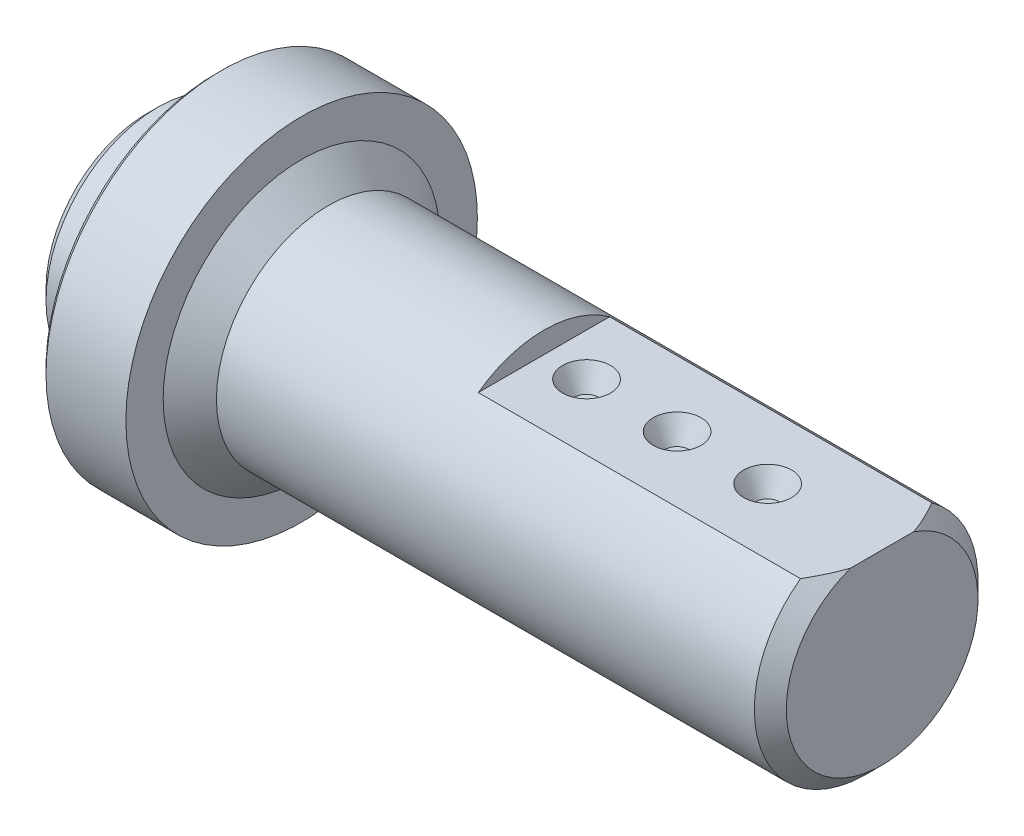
from build123d import *

# Parameters (mm, degrees)
CHANFREIN_2_45_SIZE                  = 2
CHANFREIN_1_45_SIZE                  = 1
CHANFREIN_3_45_SIZE                  = 3
ESQUISSE3_R                          = 8.5
AL_SAGE_CAPTEUR_DEPTH                = 16
ESQUISSE4_W                          = 1.1
ESQUISSE4_H                          = 8.9
CHANFREIN_1_5_45_SIZE                = 1.5
TARAUDAGE_R_EL_COUNT                 = 23
TARAUDAGE_R_EL_PITCH                 = 0.58
R_P_TITION_TROU_TARAUD_M6_COUNT      = 3
ESQUISSE7_R                          = 12
AL_SAGE_FOURCHETTE_DEPTH             = 30
M_PLAT_DEPTH                         = 146.677726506
M_PLAT_DEPTH_BACK                    = 146.677726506
ESQUISSE2_W                          = 89.086352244
ESQUISSE2_H                          = 23.534290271
ESQUISSE9_R                          = 4.5
TROU_D_INDEXAGE_DEPTH                = 4
TROU_D_INDEXAGE_DRAFT                = -30
R_P_TITION_LIN_AIRE1_COPY_1_SKETCH_R = 4.5
R_P_TITION_LIN_AIRE1_COPY_1_DEPTH    = 4
R_P_TITION_LIN_AIRE1_COPY_1_DRAFT    = -30
R_P_TITION_LIN_AIRE1_COPY_2_SKETCH_R = 4.5
R_P_TITION_LIN_AIRE1_COPY_2_DEPTH    = 4
R_P_TITION_LIN_AIRE1_COPY_2_DRAFT    = -30


with BuildPart() as part:
    # Esquisse1 → Arbre (revolve)
    with BuildSketch(Plane.XY, mode=Mode.PRIVATE) as arbre_sk:
        Polygon((0, 0), (0, 21), (13, 21), (13, 33), (29, 33), (29, 26), (34, 21), (138, 21), (138, 0), align=None)
    revolve(arbre_sk.sketch.rotate(Axis((0, 0, 0), (1, 0, 0)), 90), axis=Axis((0, 0, 0), (1, 0, 0)))

    # Chanfrein 2 _ 45
    chanfrein_2_45_edges = [part.edges().sort_by_distance(p)[0] for p in [
        (0, 0, -21),
    ]]
    chamfer(chanfrein_2_45_edges, length=CHANFREIN_2_45_SIZE)

    # Chanfrein 1 _ 45
    chanfrein_1_45_edges = [part.edges().sort_by_distance(p)[0] for p in [
        (13, 0, -33),
    ]]
    chamfer(chanfrein_1_45_edges, length=CHANFREIN_1_45_SIZE)

    # Chanfrein 3 _ 45
    chanfrein_3_45_edges = [part.edges().sort_by_distance(p)[0] for p in [
        (138, 0, -21),
    ]]
    chamfer(chanfrein_3_45_edges, length=CHANFREIN_3_45_SIZE)

    # Esquisse3 → Al_sage capteur (cut)
    with BuildSketch(Plane.ZY):
        Circle(ESQUISSE3_R)
    extrude(amount=-AL_SAGE_CAPTEUR_DEPTH, mode=Mode.SUBTRACT)

    # Esquisse4 → Gorge (revolve, cut)
    with BuildSketch(Plane.XY, mode=Mode.PRIVATE) as gorge_sk:
        with Locations((9.45, 4.45)):
            Rectangle(ESQUISSE4_W, ESQUISSE4_H)
    revolve(gorge_sk.sketch.rotate(Axis((0, 0, 0), (1, 0, 0)), 90), axis=Axis((0, 0, 0), (1, 0, 0)), mode=Mode.SUBTRACT)

    # Chanfrein 1_5 _ 45
    chanfrein_1_5_45_edges = [part.edges().sort_by_distance(p)[0] for p in [
        (0, 0, -8.5),
    ]]
    chamfer(chanfrein_1_5_45_edges, length=CHANFREIN_1_5_45_SIZE)

    # Esquisse5 → Trou taraud_ M6x1.01 (revolve, cut)
    with BuildSketch(Plane(origin=(13, 0, 27), x_dir=(0, 0, 1), z_dir=(0, 1, 0))):
        Polygon((0, 0), (0, 14.443375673), (2.5, 13), (2.5, 0), align=None)
    trou_taraud_m6x1_01 = revolve(axis=Axis((6.65, 0, 27), (1, 0, 0)), mode=Mode.SUBTRACT)

    # Esquisse10 → Repr_sentation taraudage (revolve, cut)
    with BuildSketch(Plane(origin=(0, 0, 0), x_dir=(1, 0, 0), z_dir=(0, 1, 0))):
        Polygon((13, -24), (12.711324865, -24.5), (13.288675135, -24.5), align=None)
    repr_sentation_taraudage = revolve(axis=Axis((13, 0, 27), (-1, 0, 0)), mode=Mode.SUBTRACT)

    # Taraudage r_el: Repr_sentation taraudage ×23
    with Locations(*[(i * TARAUDAGE_R_EL_PITCH, 0, 0) for i in range(1, TARAUDAGE_R_EL_COUNT)]):
        add(repr_sentation_taraudage, mode=Mode.SUBTRACT)

    # R_p_tition trou taraud_ M6: Trou taraud_ M6x1.01, Repr_sentation taraudage ×3 about axis
    r_p_tition_trou_taraud_m6_axis = Axis((0, 0, 0), (1, 0, 0))
    add([trou_taraud_m6x1_01.rotate(r_p_tition_trou_taraud_m6_axis, i * 360 / R_P_TITION_TROU_TARAUD_M6_COUNT) for i in range(1, R_P_TITION_TROU_TARAUD_M6_COUNT)], mode=Mode.SUBTRACT)
    add([repr_sentation_taraudage.rotate(r_p_tition_trou_taraud_m6_axis, i * 360 / R_P_TITION_TROU_TARAUD_M6_COUNT) for i in range(1, R_P_TITION_TROU_TARAUD_M6_COUNT)], mode=Mode.SUBTRACT)

    # R_p_tition trou taraud_ M6 copy 1 sketch → R_p_tition trou taraud_ M6 copy 1 (revolve, cut)
    with BuildSketch(Plane(origin=(0.58, 0, 0), x_dir=(1, 0, 0), z_dir=(0, -0.4999999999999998, 0.8660254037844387))):
        Polygon((13, -24), (12.711324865, -24.5), (13.288675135, -24.5), align=None)
    revolve(axis=Axis((13.58, -23.382685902, -13.5), (-1, 0, 0)), mode=Mode.SUBTRACT)

    # R_p_tition trou taraud_ M6 copy 2 sketch → R_p_tition trou taraud_ M6 copy 2 (revolve, cut)
    with BuildSketch(Plane(origin=(0.58, 0, 0), x_dir=(1, 0, 0), z_dir=(0, -0.5000000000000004, -0.8660254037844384))):
        Polygon((13, -24), (12.711324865, -24.5), (13.288675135, -24.5), align=None)
    revolve(axis=Axis((13.58, 23.382685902, -13.5), (-1, 0, 0)), mode=Mode.SUBTRACT)

    # R_p_tition trou taraud_ M6 copy 3 sketch → R_p_tition trou taraud_ M6 copy 3 (revolve, cut)
    with BuildSketch(Plane(origin=(1.16, 0, 0), x_dir=(1, 0, 0), z_dir=(0, -0.4999999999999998, 0.8660254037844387))):
        Polygon((13, -24), (12.711324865, -24.5), (13.288675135, -24.5), align=None)
    revolve(axis=Axis((14.16, -23.382685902, -13.5), (-1, 0, 0)), mode=Mode.SUBTRACT)

    # R_p_tition trou taraud_ M6 copy 4 sketch → R_p_tition trou taraud_ M6 copy 4 (revolve, cut)
    with BuildSketch(Plane(origin=(1.16, 0, 0), x_dir=(1, 0, 0), z_dir=(0, -0.5000000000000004, -0.8660254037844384))):
        Polygon((13, -24), (12.711324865, -24.5), (13.288675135, -24.5), align=None)
    revolve(axis=Axis((14.16, 23.382685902, -13.5), (-1, 0, 0)), mode=Mode.SUBTRACT)

    # R_p_tition trou taraud_ M6 copy 5 sketch → R_p_tition trou taraud_ M6 copy 5 (revolve, cut)
    with BuildSketch(Plane(origin=(1.74, 0, 0), x_dir=(1, 0, 0), z_dir=(0, -0.4999999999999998, 0.8660254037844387))):
        Polygon((13, -24), (12.711324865, -24.5), (13.288675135, -24.5), align=None)
    revolve(axis=Axis((14.74, -23.382685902, -13.5), (-1, 0, 0)), mode=Mode.SUBTRACT)

    # R_p_tition trou taraud_ M6 copy 6 sketch → R_p_tition trou taraud_ M6 copy 6 (revolve, cut)
    with BuildSketch(Plane(origin=(1.74, 0, 0), x_dir=(1, 0, 0), z_dir=(0, -0.5000000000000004, -0.8660254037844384))):
        Polygon((13, -24), (12.711324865, -24.5), (13.288675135, -24.5), align=None)
    revolve(axis=Axis((14.74, 23.382685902, -13.5), (-1, 0, 0)), mode=Mode.SUBTRACT)

    # R_p_tition trou taraud_ M6 copy 7 sketch → R_p_tition trou taraud_ M6 copy 7 (revolve, cut)
    with BuildSketch(Plane(origin=(2.32, 0, 0), x_dir=(1, 0, 0), z_dir=(0, -0.4999999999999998, 0.8660254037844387))):
        Polygon((13, -24), (12.711324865, -24.5), (13.288675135, -24.5), align=None)
    revolve(axis=Axis((15.32, -23.382685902, -13.5), (-1, 0, 0)), mode=Mode.SUBTRACT)

    # R_p_tition trou taraud_ M6 copy 8 sketch → R_p_tition trou taraud_ M6 copy 8 (revolve, cut)
    with BuildSketch(Plane(origin=(2.32, 0, 0), x_dir=(1, 0, 0), z_dir=(0, -0.5000000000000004, -0.8660254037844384))):
        Polygon((13, -24), (12.711324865, -24.5), (13.288675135, -24.5), align=None)
    revolve(axis=Axis((15.32, 23.382685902, -13.5), (-1, 0, 0)), mode=Mode.SUBTRACT)

    # R_p_tition trou taraud_ M6 copy 9 sketch → R_p_tition trou taraud_ M6 copy 9 (revolve, cut)
    with BuildSketch(Plane(origin=(2.9, 0, 0), x_dir=(1, 0, 0), z_dir=(0, -0.4999999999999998, 0.8660254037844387))):
        Polygon((13, -24), (12.711324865, -24.5), (13.288675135, -24.5), align=None)
    revolve(axis=Axis((15.9, -23.382685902, -13.5), (-1, 0, 0)), mode=Mode.SUBTRACT)

    # R_p_tition trou taraud_ M6 copy 10 sketc → R_p_tition trou taraud_ M6 copy 10 (revolve, cut)
    with BuildSketch(Plane(origin=(2.9, 0, 0), x_dir=(1, 0, 0), z_dir=(0, -0.5000000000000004, -0.8660254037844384))):
        Polygon((13, -24), (12.711324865, -24.5), (13.288675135, -24.5), align=None)
    revolve(axis=Axis((15.9, 23.382685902, -13.5), (-1, 0, 0)), mode=Mode.SUBTRACT)

    # R_p_tition trou taraud_ M6 copy 11 sketc → R_p_tition trou taraud_ M6 copy 11 (revolve, cut)
    with BuildSketch(Plane(origin=(3.48, 0, 0), x_dir=(1, 0, 0), z_dir=(0, -0.4999999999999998, 0.8660254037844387))):
        Polygon((13, -24), (12.711324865, -24.5), (13.288675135, -24.5), align=None)
    revolve(axis=Axis((16.48, -23.382685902, -13.5), (-1, 0, 0)), mode=Mode.SUBTRACT)

    # R_p_tition trou taraud_ M6 copy 12 sketc → R_p_tition trou taraud_ M6 copy 12 (revolve, cut)
    with BuildSketch(Plane(origin=(3.48, 0, 0), x_dir=(1, 0, 0), z_dir=(0, -0.5000000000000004, -0.8660254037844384))):
        Polygon((13, -24), (12.711324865, -24.5), (13.288675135, -24.5), align=None)
    revolve(axis=Axis((16.48, 23.382685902, -13.5), (-1, 0, 0)), mode=Mode.SUBTRACT)

    # R_p_tition trou taraud_ M6 copy 13 sketc → R_p_tition trou taraud_ M6 copy 13 (revolve, cut)
    with BuildSketch(Plane(origin=(4.06, 0, 0), x_dir=(1, 0, 0), z_dir=(0, -0.4999999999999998, 0.8660254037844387))):
        Polygon((13, -24), (12.711324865, -24.5), (13.288675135, -24.5), align=None)
    revolve(axis=Axis((17.06, -23.382685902, -13.5), (-1, 0, 0)), mode=Mode.SUBTRACT)

    # R_p_tition trou taraud_ M6 copy 14 sketc → R_p_tition trou taraud_ M6 copy 14 (revolve, cut)
    with BuildSketch(Plane(origin=(4.06, 0, 0), x_dir=(1, 0, 0), z_dir=(0, -0.5000000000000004, -0.8660254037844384))):
        Polygon((13, -24), (12.711324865, -24.5), (13.288675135, -24.5), align=None)
    revolve(axis=Axis((17.06, 23.382685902, -13.5), (-1, 0, 0)), mode=Mode.SUBTRACT)

    # R_p_tition trou taraud_ M6 copy 15 sketc → R_p_tition trou taraud_ M6 copy 15 (revolve, cut)
    with BuildSketch(Plane(origin=(4.64, 0, 0), x_dir=(1, 0, 0), z_dir=(0, -0.4999999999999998, 0.8660254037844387))):
        Polygon((13, -24), (12.711324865, -24.5), (13.288675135, -24.5), align=None)
    revolve(axis=Axis((17.64, -23.382685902, -13.5), (-1, 0, 0)), mode=Mode.SUBTRACT)

    # R_p_tition trou taraud_ M6 copy 16 sketc → R_p_tition trou taraud_ M6 copy 16 (revolve, cut)
    with BuildSketch(Plane(origin=(4.64, 0, 0), x_dir=(1, 0, 0), z_dir=(0, -0.5000000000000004, -0.8660254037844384))):
        Polygon((13, -24), (12.711324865, -24.5), (13.288675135, -24.5), align=None)
    revolve(axis=Axis((17.64, 23.382685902, -13.5), (-1, 0, 0)), mode=Mode.SUBTRACT)

    # R_p_tition trou taraud_ M6 copy 17 sketc → R_p_tition trou taraud_ M6 copy 17 (revolve, cut)
    with BuildSketch(Plane(origin=(5.22, 0, 0), x_dir=(1, 0, 0), z_dir=(0, -0.4999999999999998, 0.8660254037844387))):
        Polygon((13, -24), (12.711324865, -24.5), (13.288675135, -24.5), align=None)
    revolve(axis=Axis((18.22, -23.382685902, -13.5), (-1, 0, 0)), mode=Mode.SUBTRACT)

    # R_p_tition trou taraud_ M6 copy 18 sketc → R_p_tition trou taraud_ M6 copy 18 (revolve, cut)
    with BuildSketch(Plane(origin=(5.22, 0, 0), x_dir=(1, 0, 0), z_dir=(0, -0.5000000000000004, -0.8660254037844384))):
        Polygon((13, -24), (12.711324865, -24.5), (13.288675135, -24.5), align=None)
    revolve(axis=Axis((18.22, 23.382685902, -13.5), (-1, 0, 0)), mode=Mode.SUBTRACT)

    # R_p_tition trou taraud_ M6 copy 19 sketc → R_p_tition trou taraud_ M6 copy 19 (revolve, cut)
    with BuildSketch(Plane(origin=(5.8, 0, 0), x_dir=(1, 0, 0), z_dir=(0, -0.4999999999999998, 0.8660254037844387))):
        Polygon((13, -24), (12.711324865, -24.5), (13.288675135, -24.5), align=None)
    revolve(axis=Axis((18.8, -23.382685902, -13.5), (-1, 0, 0)), mode=Mode.SUBTRACT)

    # R_p_tition trou taraud_ M6 copy 20 sketc → R_p_tition trou taraud_ M6 copy 20 (revolve, cut)
    with BuildSketch(Plane(origin=(5.8, 0, 0), x_dir=(1, 0, 0), z_dir=(0, -0.5000000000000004, -0.8660254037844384))):
        Polygon((13, -24), (12.711324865, -24.5), (13.288675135, -24.5), align=None)
    revolve(axis=Axis((18.8, 23.382685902, -13.5), (-1, 0, 0)), mode=Mode.SUBTRACT)

    # R_p_tition trou taraud_ M6 copy 21 sketc → R_p_tition trou taraud_ M6 copy 21 (revolve, cut)
    with BuildSketch(Plane(origin=(6.38, 0, 0), x_dir=(1, 0, 0), z_dir=(0, -0.4999999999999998, 0.8660254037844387))):
        Polygon((13, -24), (12.711324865, -24.5), (13.288675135, -24.5), align=None)
    revolve(axis=Axis((19.38, -23.382685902, -13.5), (-1, 0, 0)), mode=Mode.SUBTRACT)

    # R_p_tition trou taraud_ M6 copy 22 sketc → R_p_tition trou taraud_ M6 copy 22 (revolve, cut)
    with BuildSketch(Plane(origin=(6.38, 0, 0), x_dir=(1, 0, 0), z_dir=(0, -0.5000000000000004, -0.8660254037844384))):
        Polygon((13, -24), (12.711324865, -24.5), (13.288675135, -24.5), align=None)
    revolve(axis=Axis((19.38, 23.382685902, -13.5), (-1, 0, 0)), mode=Mode.SUBTRACT)

    # R_p_tition trou taraud_ M6 copy 23 sketc → R_p_tition trou taraud_ M6 copy 23 (revolve, cut)
    with BuildSketch(Plane(origin=(6.96, 0, 0), x_dir=(1, 0, 0), z_dir=(0, -0.4999999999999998, 0.8660254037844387))):
        Polygon((13, -24), (12.711324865, -24.5), (13.288675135, -24.5), align=None)
    revolve(axis=Axis((19.96, -23.382685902, -13.5), (-1, 0, 0)), mode=Mode.SUBTRACT)

    # R_p_tition trou taraud_ M6 copy 24 sketc → R_p_tition trou taraud_ M6 copy 24 (revolve, cut)
    with BuildSketch(Plane(origin=(6.96, 0, 0), x_dir=(1, 0, 0), z_dir=(0, -0.5000000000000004, -0.8660254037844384))):
        Polygon((13, -24), (12.711324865, -24.5), (13.288675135, -24.5), align=None)
    revolve(axis=Axis((19.96, 23.382685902, -13.5), (-1, 0, 0)), mode=Mode.SUBTRACT)

    # R_p_tition trou taraud_ M6 copy 25 sketc → R_p_tition trou taraud_ M6 copy 25 (revolve, cut)
    with BuildSketch(Plane(origin=(7.54, 0, 0), x_dir=(1, 0, 0), z_dir=(0, -0.4999999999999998, 0.8660254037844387))):
        Polygon((13, -24), (12.711324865, -24.5), (13.288675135, -24.5), align=None)
    revolve(axis=Axis((20.54, -23.382685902, -13.5), (-1, 0, 0)), mode=Mode.SUBTRACT)

    # R_p_tition trou taraud_ M6 copy 26 sketc → R_p_tition trou taraud_ M6 copy 26 (revolve, cut)
    with BuildSketch(Plane(origin=(7.54, 0, 0), x_dir=(1, 0, 0), z_dir=(0, -0.5000000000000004, -0.8660254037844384))):
        Polygon((13, -24), (12.711324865, -24.5), (13.288675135, -24.5), align=None)
    revolve(axis=Axis((20.54, 23.382685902, -13.5), (-1, 0, 0)), mode=Mode.SUBTRACT)

    # R_p_tition trou taraud_ M6 copy 27 sketc → R_p_tition trou taraud_ M6 copy 27 (revolve, cut)
    with BuildSketch(Plane(origin=(8.12, 0, 0), x_dir=(1, 0, 0), z_dir=(0, -0.4999999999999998, 0.8660254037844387))):
        Polygon((13, -24), (12.711324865, -24.5), (13.288675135, -24.5), align=None)
    revolve(axis=Axis((21.12, -23.382685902, -13.5), (-1, 0, 0)), mode=Mode.SUBTRACT)

    # R_p_tition trou taraud_ M6 copy 28 sketc → R_p_tition trou taraud_ M6 copy 28 (revolve, cut)
    with BuildSketch(Plane(origin=(8.12, 0, 0), x_dir=(1, 0, 0), z_dir=(0, -0.5000000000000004, -0.8660254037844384))):
        Polygon((13, -24), (12.711324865, -24.5), (13.288675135, -24.5), align=None)
    revolve(axis=Axis((21.12, 23.382685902, -13.5), (-1, 0, 0)), mode=Mode.SUBTRACT)

    # R_p_tition trou taraud_ M6 copy 29 sketc → R_p_tition trou taraud_ M6 copy 29 (revolve, cut)
    with BuildSketch(Plane(origin=(8.7, 0, 0), x_dir=(1, 0, 0), z_dir=(0, -0.4999999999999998, 0.8660254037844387))):
        Polygon((13, -24), (12.711324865, -24.5), (13.288675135, -24.5), align=None)
    revolve(axis=Axis((21.7, -23.382685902, -13.5), (-1, 0, 0)), mode=Mode.SUBTRACT)

    # R_p_tition trou taraud_ M6 copy 30 sketc → R_p_tition trou taraud_ M6 copy 30 (revolve, cut)
    with BuildSketch(Plane(origin=(8.7, 0, 0), x_dir=(1, 0, 0), z_dir=(0, -0.5000000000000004, -0.8660254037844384))):
        Polygon((13, -24), (12.711324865, -24.5), (13.288675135, -24.5), align=None)
    revolve(axis=Axis((21.7, 23.382685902, -13.5), (-1, 0, 0)), mode=Mode.SUBTRACT)

    # R_p_tition trou taraud_ M6 copy 31 sketc → R_p_tition trou taraud_ M6 copy 31 (revolve, cut)
    with BuildSketch(Plane(origin=(9.28, 0, 0), x_dir=(1, 0, 0), z_dir=(0, -0.4999999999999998, 0.8660254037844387))):
        Polygon((13, -24), (12.711324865, -24.5), (13.288675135, -24.5), align=None)
    revolve(axis=Axis((22.28, -23.382685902, -13.5), (-1, 0, 0)), mode=Mode.SUBTRACT)

    # R_p_tition trou taraud_ M6 copy 32 sketc → R_p_tition trou taraud_ M6 copy 32 (revolve, cut)
    with BuildSketch(Plane(origin=(9.28, 0, 0), x_dir=(1, 0, 0), z_dir=(0, -0.5000000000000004, -0.8660254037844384))):
        Polygon((13, -24), (12.711324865, -24.5), (13.288675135, -24.5), align=None)
    revolve(axis=Axis((22.28, 23.382685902, -13.5), (-1, 0, 0)), mode=Mode.SUBTRACT)

    # R_p_tition trou taraud_ M6 copy 33 sketc → R_p_tition trou taraud_ M6 copy 33 (revolve, cut)
    with BuildSketch(Plane(origin=(9.86, 0, 0), x_dir=(1, 0, 0), z_dir=(0, -0.4999999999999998, 0.8660254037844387))):
        Polygon((13, -24), (12.711324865, -24.5), (13.288675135, -24.5), align=None)
    revolve(axis=Axis((22.86, -23.382685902, -13.5), (-1, 0, 0)), mode=Mode.SUBTRACT)

    # R_p_tition trou taraud_ M6 copy 34 sketc → R_p_tition trou taraud_ M6 copy 34 (revolve, cut)
    with BuildSketch(Plane(origin=(9.86, 0, 0), x_dir=(1, 0, 0), z_dir=(0, -0.5000000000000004, -0.8660254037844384))):
        Polygon((13, -24), (12.711324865, -24.5), (13.288675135, -24.5), align=None)
    revolve(axis=Axis((22.86, 23.382685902, -13.5), (-1, 0, 0)), mode=Mode.SUBTRACT)

    # R_p_tition trou taraud_ M6 copy 35 sketc → R_p_tition trou taraud_ M6 copy 35 (revolve, cut)
    with BuildSketch(Plane(origin=(10.44, 0, 0), x_dir=(1, 0, 0), z_dir=(0, -0.4999999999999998, 0.8660254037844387))):
        Polygon((13, -24), (12.711324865, -24.5), (13.288675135, -24.5), align=None)
    revolve(axis=Axis((23.44, -23.382685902, -13.5), (-1, 0, 0)), mode=Mode.SUBTRACT)

    # R_p_tition trou taraud_ M6 copy 36 sketc → R_p_tition trou taraud_ M6 copy 36 (revolve, cut)
    with BuildSketch(Plane(origin=(10.44, 0, 0), x_dir=(1, 0, 0), z_dir=(0, -0.5000000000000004, -0.8660254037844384))):
        Polygon((13, -24), (12.711324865, -24.5), (13.288675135, -24.5), align=None)
    revolve(axis=Axis((23.44, 23.382685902, -13.5), (-1, 0, 0)), mode=Mode.SUBTRACT)

    # R_p_tition trou taraud_ M6 copy 37 sketc → R_p_tition trou taraud_ M6 copy 37 (revolve, cut)
    with BuildSketch(Plane(origin=(11.02, 0, 0), x_dir=(1, 0, 0), z_dir=(0, -0.4999999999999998, 0.8660254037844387))):
        Polygon((13, -24), (12.711324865, -24.5), (13.288675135, -24.5), align=None)
    revolve(axis=Axis((24.02, -23.382685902, -13.5), (-1, 0, 0)), mode=Mode.SUBTRACT)

    # R_p_tition trou taraud_ M6 copy 38 sketc → R_p_tition trou taraud_ M6 copy 38 (revolve, cut)
    with BuildSketch(Plane(origin=(11.02, 0, 0), x_dir=(1, 0, 0), z_dir=(0, -0.5000000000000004, -0.8660254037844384))):
        Polygon((13, -24), (12.711324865, -24.5), (13.288675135, -24.5), align=None)
    revolve(axis=Axis((24.02, 23.382685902, -13.5), (-1, 0, 0)), mode=Mode.SUBTRACT)

    # R_p_tition trou taraud_ M6 copy 39 sketc → R_p_tition trou taraud_ M6 copy 39 (revolve, cut)
    with BuildSketch(Plane(origin=(11.6, 0, 0), x_dir=(1, 0, 0), z_dir=(0, -0.4999999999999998, 0.8660254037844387))):
        Polygon((13, -24), (12.711324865, -24.5), (13.288675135, -24.5), align=None)
    revolve(axis=Axis((24.6, -23.382685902, -13.5), (-1, 0, 0)), mode=Mode.SUBTRACT)

    # R_p_tition trou taraud_ M6 copy 40 sketc → R_p_tition trou taraud_ M6 copy 40 (revolve, cut)
    with BuildSketch(Plane(origin=(11.6, 0, 0), x_dir=(1, 0, 0), z_dir=(0, -0.5000000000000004, -0.8660254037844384))):
        Polygon((13, -24), (12.711324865, -24.5), (13.288675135, -24.5), align=None)
    revolve(axis=Axis((24.6, 23.382685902, -13.5), (-1, 0, 0)), mode=Mode.SUBTRACT)

    # R_p_tition trou taraud_ M6 copy 41 sketc → R_p_tition trou taraud_ M6 copy 41 (revolve, cut)
    with BuildSketch(Plane(origin=(12.18, 0, 0), x_dir=(1, 0, 0), z_dir=(0, -0.4999999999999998, 0.8660254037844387))):
        Polygon((13, -24), (12.711324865, -24.5), (13.288675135, -24.5), align=None)
    revolve(axis=Axis((25.18, -23.382685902, -13.5), (-1, 0, 0)), mode=Mode.SUBTRACT)

    # R_p_tition trou taraud_ M6 copy 42 sketc → R_p_tition trou taraud_ M6 copy 42 (revolve, cut)
    with BuildSketch(Plane(origin=(12.18, 0, 0), x_dir=(1, 0, 0), z_dir=(0, -0.5000000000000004, -0.8660254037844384))):
        Polygon((13, -24), (12.711324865, -24.5), (13.288675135, -24.5), align=None)
    revolve(axis=Axis((25.18, 23.382685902, -13.5), (-1, 0, 0)), mode=Mode.SUBTRACT)

    # R_p_tition trou taraud_ M6 copy 43 sketc → R_p_tition trou taraud_ M6 copy 43 (revolve, cut)
    with BuildSketch(Plane(origin=(12.76, 0, 0), x_dir=(1, 0, 0), z_dir=(0, -0.4999999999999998, 0.8660254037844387))):
        Polygon((13, -24), (12.711324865, -24.5), (13.288675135, -24.5), align=None)
    revolve(axis=Axis((25.76, -23.382685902, -13.5), (-1, 0, 0)), mode=Mode.SUBTRACT)

    # R_p_tition trou taraud_ M6 copy 44 sketc → R_p_tition trou taraud_ M6 copy 44 (revolve, cut)
    with BuildSketch(Plane(origin=(12.76, 0, 0), x_dir=(1, 0, 0), z_dir=(0, -0.5000000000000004, -0.8660254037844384))):
        Polygon((13, -24), (12.711324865, -24.5), (13.288675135, -24.5), align=None)
    revolve(axis=Axis((25.76, 23.382685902, -13.5), (-1, 0, 0)), mode=Mode.SUBTRACT)

    # Esquisse7 → Al_sage fourchette (cut)
    with BuildSketch(Plane(origin=(0, -21, 0), x_dir=(-1, 0, 0), z_dir=(0, 1, 0))):
        with Locations(Location((-111.6, 0, 0), (0, 0, 270))):
            Circle(ESQUISSE7_R)
    extrude(amount=AL_SAGE_FOURCHETTE_DEPTH, mode=Mode.SUBTRACT)

    # Esquisse8 → Chanfrein (revolve, cut)
    with BuildSketch(Plane.XY, mode=Mode.PRIVATE) as chanfrein_sk:
        Polygon((99.6, -21), (99.6, -18), (96.6, -21), align=None)
    revolve(chanfrein_sk.sketch.rotate(Axis((111.6, 9, 0), (0, -1, 0)), 64.341093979), axis=Axis((111.6, 9, 0), (0, -1, 0)), mode=Mode.SUBTRACT)

    # Esquisse2 → M_plat (cut, two sides: drawn at the far end of the back side and taken through both)
    with BuildSketch(Plane.XY.offset(-M_PLAT_DEPTH_BACK)):
        with Locations((119.043176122, 28.767145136)):
            Rectangle(ESQUISSE2_W, ESQUISSE2_H)
    extrude(amount=M_PLAT_DEPTH + M_PLAT_DEPTH_BACK, mode=Mode.SUBTRACT)


with BuildPart() as trou_d_indexage_tool:
    # Esquisse9 → Trou d_indexage (with draft: the straight prism first)
    with BuildSketch(Plane(origin=(0, 17, 0), x_dir=(-1, 0, 0), z_dir=(0, 1, 0))):
        with Locations((-82.5, 0)):
            Circle(ESQUISSE9_R)
    extrude(amount=-TROU_D_INDEXAGE_DEPTH)
    # Trou d_indexage: the draft: its side faces are tilted about the plane it starts from
    trou_d_indexage_sides = [trou_d_indexage_tool.faces().sort_by_distance(p)[0] for p in [
        (87, 15, 0),
    ]]
    draft(trou_d_indexage_sides, Plane(origin=(0, 17, 0), x_dir=(-1, 0, 0), z_dir=(0, 1, 0)), TROU_D_INDEXAGE_DRAFT)


with BuildPart() as part_1:
    add(part.part)

    # Trou d_indexage: cut by trou_d_indexage_tool
    add(trou_d_indexage_tool.part, mode=Mode.SUBTRACT)


with BuildPart() as r_p_tition_lin_aire1_copy_1_tool:
    # R_p_tition lin_aire1 copy 1 sketch → R_p_tition lin_aire1 copy 1 (with draft: the straight prism first)
    with BuildSketch(Plane(origin=(17, 17, 0), x_dir=(-1, 0, 0), z_dir=(0, 1, 0))):
        with Locations((-82.5, 0)):
            Circle(R_P_TITION_LIN_AIRE1_COPY_1_SKETCH_R)
    extrude(amount=-R_P_TITION_LIN_AIRE1_COPY_1_DEPTH)
    # R_p_tition lin_aire1 copy 1: the draft: its side faces are tilted about the plane it starts from
    r_p_tition_lin_aire1_copy_1_sides = [r_p_tition_lin_aire1_copy_1_tool.faces().sort_by_distance(p)[0] for p in [
        (104, 15, 0),
    ]]
    draft(r_p_tition_lin_aire1_copy_1_sides, Plane(origin=(17, 17, 0), x_dir=(-1, 0, 0), z_dir=(0, 1, 0)), R_P_TITION_LIN_AIRE1_COPY_1_DRAFT)


with BuildPart() as part_2:
    add(part_1.part)

    # R_p_tition lin_aire1 copy 1: cut by r_p_tition_lin_aire1_copy_1_tool
    add(r_p_tition_lin_aire1_copy_1_tool.part, mode=Mode.SUBTRACT)


with BuildPart() as r_p_tition_lin_aire1_copy_2_tool:
    # R_p_tition lin_aire1 copy 2 sketch → R_p_tition lin_aire1 copy 2 (with draft: the straight prism first)
    with BuildSketch(Plane(origin=(34, 17, 0), x_dir=(-1, 0, 0), z_dir=(0, 1, 0))):
        with Locations((-82.5, 0)):
            Circle(R_P_TITION_LIN_AIRE1_COPY_2_SKETCH_R)
    extrude(amount=-R_P_TITION_LIN_AIRE1_COPY_2_DEPTH)
    # R_p_tition lin_aire1 copy 2: the draft: its side faces are tilted about the plane it starts from
    r_p_tition_lin_aire1_copy_2_sides = [r_p_tition_lin_aire1_copy_2_tool.faces().sort_by_distance(p)[0] for p in [
        (121, 15, 0),
    ]]
    draft(r_p_tition_lin_aire1_copy_2_sides, Plane(origin=(34, 17, 0), x_dir=(-1, 0, 0), z_dir=(0, 1, 0)), R_P_TITION_LIN_AIRE1_COPY_2_DRAFT)


with BuildPart() as part_3:
    add(part_2.part)

    # R_p_tition lin_aire1 copy 2: cut by r_p_tition_lin_aire1_copy_2_tool
    add(r_p_tition_lin_aire1_copy_2_tool.part, mode=Mode.SUBTRACT)


solid = part_3.part
